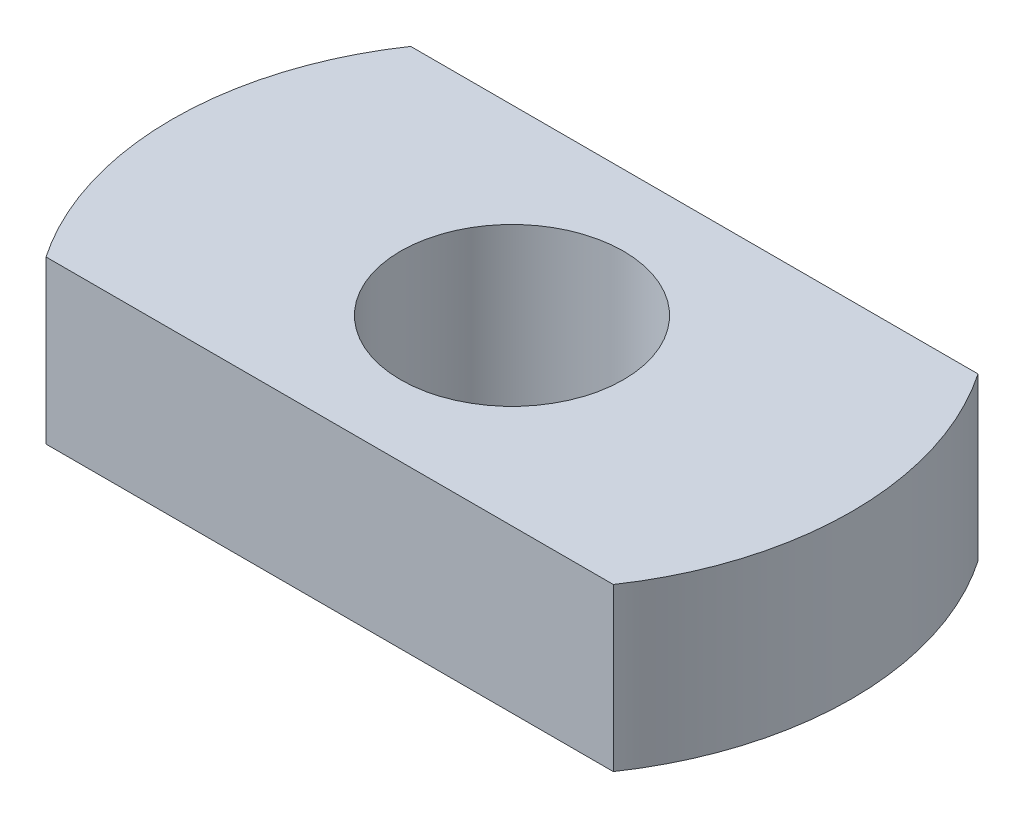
ISO-10303-21;
HEADER;
FILE_DESCRIPTION(('STEP AP214'),'2;1');
FILE_NAME('part.step','',(''),(''),'','','');
FILE_SCHEMA(('AUTOMOTIVE_DESIGN { 1 0 10303 214 1 1 1 1 }'));
ENDSEC;
DATA;
#1=APPLICATION_CONTEXT('core data for automotive mechanical design processes');
#2=APPLICATION_PROTOCOL_DEFINITION('international standard','automotive_design',2000,#1);
#3=PRODUCT_CONTEXT('',#1,'mechanical');
#4=PRODUCT('Part','Part','',(#3));
#5=PRODUCT_RELATED_PRODUCT_CATEGORY('part','',(#4));
#6=PRODUCT_DEFINITION_FORMATION('','',#4);
#7=PRODUCT_DEFINITION_CONTEXT('part definition',#1,'design');
#8=PRODUCT_DEFINITION('design','',#6,#7);
#9=PRODUCT_DEFINITION_SHAPE('','',#8);
#10=(LENGTH_UNIT() NAMED_UNIT(*) SI_UNIT(.MILLI.,.METRE.));
#11=(NAMED_UNIT(*) PLANE_ANGLE_UNIT() SI_UNIT($,.RADIAN.));
#12=(NAMED_UNIT(*) SI_UNIT($,.STERADIAN.) SOLID_ANGLE_UNIT());
#13=UNCERTAINTY_MEASURE_WITH_UNIT(LENGTH_MEASURE(1.E-05),#10,'distance_accuracy_value','');
#14=(GEOMETRIC_REPRESENTATION_CONTEXT(3) GLOBAL_UNCERTAINTY_ASSIGNED_CONTEXT((#13)) GLOBAL_UNIT_ASSIGNED_CONTEXT((#10,
#11,#12)) REPRESENTATION_CONTEXT('',''));
#15=CARTESIAN_POINT('',(0.,0.,0.));
#16=DIRECTION('',(0.,0.,1.));
#17=DIRECTION('',(1.,0.,0.));
#18=AXIS2_PLACEMENT_3D('',#15,#16,#17);
#19=CARTESIAN_POINT('',(-3.85621722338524,40.,0.));
#20=DIRECTION('',(0.,1.,0.));
#21=DIRECTION('',(0.,0.,1.));
#22=AXIS2_PLACEMENT_3D('',#19,#20,#21);
#23=PLANE('',#22);
#24=CARTESIAN_POINT('',(-3.85621722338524,40.,0.));
#25=DIRECTION('',(0.,1.,0.));
#26=DIRECTION('',(0.,0.,1.));
#27=AXIS2_PLACEMENT_3D('',#24,#25,#26);
#28=CIRCLE('',#27,80.);
#29=CARTESIAN_POINT('',(-70.,40.,-45.));
#30=VERTEX_POINT('',#29);
#31=CARTESIAN_POINT('',(-70.,40.,45.));
#32=VERTEX_POINT('',#31);
#33=EDGE_CURVE('E95',#30,#32,#28,.T.);
#34=ORIENTED_EDGE('',*,*,#33,.T.);
#35=DIRECTION('',(1.,0.,0.));
#36=VECTOR('',#35,1.);
#37=CARTESIAN_POINT('',(-70.,40.,45.));
#38=LINE('',#37,#36);
#39=CARTESIAN_POINT('',(70.,40.,45.));
#40=VERTEX_POINT('',#39);
#41=EDGE_CURVE('E90',#32,#40,#38,.T.);
#42=ORIENTED_EDGE('',*,*,#41,.T.);
#43=CARTESIAN_POINT('',(3.85621722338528,40.,0.));
#44=DIRECTION('',(0.,1.,0.));
#45=DIRECTION('',(0.,0.,-1.));
#46=AXIS2_PLACEMENT_3D('',#43,#44,#45);
#47=CIRCLE('',#46,80.);
#48=CARTESIAN_POINT('',(70.,40.,-45.));
#49=VERTEX_POINT('',#48);
#50=EDGE_CURVE('E93',#40,#49,#47,.T.);
#51=ORIENTED_EDGE('',*,*,#50,.T.);
#52=DIRECTION('',(-1.,0.,0.));
#53=VECTOR('',#52,1.);
#54=CARTESIAN_POINT('',(-70.,40.,-45.));
#55=LINE('',#54,#53);
#56=EDGE_CURVE('E60',#49,#30,#55,.T.);
#57=ORIENTED_EDGE('',*,*,#56,.T.);
#58=EDGE_LOOP('',(#34,#42,#51,#57));
#59=FACE_BOUND('',#58,.T.);
#60=CARTESIAN_POINT('',(0.,40.,0.));
#61=DIRECTION('',(0.,1.,0.));
#62=DIRECTION('',(0.,0.,1.));
#63=AXIS2_PLACEMENT_3D('',#60,#61,#62);
#64=CIRCLE('',#63,27.5);
#65=CARTESIAN_POINT('',(0.,40.,27.5));
#66=VERTEX_POINT('',#65);
#67=EDGE_CURVE('E110',#66,#66,#64,.T.);
#68=ORIENTED_EDGE('',*,*,#67,.F.);
#69=EDGE_LOOP('',(#68));
#70=FACE_BOUND('',#69,.T.);
#71=ADVANCED_FACE('F43',(#59,#70),#23,.T.);
#72=CARTESIAN_POINT('',(-3.85621722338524,0.,0.));
#73=DIRECTION('',(0.,1.,0.));
#74=DIRECTION('',(0.,0.,1.));
#75=AXIS2_PLACEMENT_3D('',#72,#73,#74);
#76=PLANE('',#75);
#77=CARTESIAN_POINT('',(-3.85621722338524,0.,0.));
#78=DIRECTION('',(0.,1.,0.));
#79=DIRECTION('',(0.,0.,1.));
#80=AXIS2_PLACEMENT_3D('',#77,#78,#79);
#81=CIRCLE('',#80,80.);
#82=CARTESIAN_POINT('',(-70.,0.,-45.));
#83=VERTEX_POINT('',#82);
#84=CARTESIAN_POINT('',(-70.,0.,45.));
#85=VERTEX_POINT('',#84);
#86=EDGE_CURVE('E107',#83,#85,#81,.T.);
#87=ORIENTED_EDGE('',*,*,#86,.F.);
#88=DIRECTION('',(-1.,0.,0.));
#89=VECTOR('',#88,1.);
#90=CARTESIAN_POINT('',(-70.,0.,-45.));
#91=LINE('',#90,#89);
#92=CARTESIAN_POINT('',(70.,0.,-45.));
#93=VERTEX_POINT('',#92);
#94=EDGE_CURVE('E83',#93,#83,#91,.T.);
#95=ORIENTED_EDGE('',*,*,#94,.F.);
#96=CARTESIAN_POINT('',(3.85621722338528,0.,0.));
#97=DIRECTION('',(0.,1.,0.));
#98=DIRECTION('',(0.,0.,-1.));
#99=AXIS2_PLACEMENT_3D('',#96,#97,#98);
#100=CIRCLE('',#99,80.);
#101=CARTESIAN_POINT('',(70.,0.,45.));
#102=VERTEX_POINT('',#101);
#103=EDGE_CURVE('E77',#102,#93,#100,.T.);
#104=ORIENTED_EDGE('',*,*,#103,.F.);
#105=DIRECTION('',(1.,0.,0.));
#106=VECTOR('',#105,1.);
#107=CARTESIAN_POINT('',(-70.,0.,45.));
#108=LINE('',#107,#106);
#109=EDGE_CURVE('E99',#85,#102,#108,.T.);
#110=ORIENTED_EDGE('',*,*,#109,.F.);
#111=EDGE_LOOP('',(#87,#95,#104,#110));
#112=FACE_BOUND('',#111,.T.);
#113=CARTESIAN_POINT('',(0.,0.,0.));
#114=DIRECTION('',(0.,1.,0.));
#115=DIRECTION('',(0.,0.,1.));
#116=AXIS2_PLACEMENT_3D('',#113,#114,#115);
#117=CIRCLE('',#116,27.5);
#118=CARTESIAN_POINT('',(0.,0.,27.5));
#119=VERTEX_POINT('',#118);
#120=EDGE_CURVE('E122',#119,#119,#117,.T.);
#121=ORIENTED_EDGE('',*,*,#120,.T.);
#122=EDGE_LOOP('',(#121));
#123=FACE_BOUND('',#122,.T.);
#124=ADVANCED_FACE('F118',(#112,#123),#76,.F.);
#125=CARTESIAN_POINT('',(-3.85621722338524,40.,0.));
#126=DIRECTION('',(0.,-1.,0.));
#127=DIRECTION('',(0.,0.,-1.));
#128=AXIS2_PLACEMENT_3D('',#125,#126,#127);
#129=CYLINDRICAL_SURFACE('',#128,80.);
#130=ORIENTED_EDGE('',*,*,#86,.T.);
#131=DIRECTION('',(0.,-1.,0.));
#132=VECTOR('',#131,1.);
#133=CARTESIAN_POINT('',(-70.,40.,45.));
#134=LINE('',#133,#132);
#135=EDGE_CURVE('E13',#32,#85,#134,.T.);
#136=ORIENTED_EDGE('',*,*,#135,.F.);
#137=ORIENTED_EDGE('',*,*,#33,.F.);
#138=DIRECTION('',(0.,-1.,0.));
#139=VECTOR('',#138,1.);
#140=CARTESIAN_POINT('',(-70.,40.,-45.));
#141=LINE('',#140,#139);
#142=EDGE_CURVE('E103',#30,#83,#141,.T.);
#143=ORIENTED_EDGE('',*,*,#142,.T.);
#144=EDGE_LOOP('',(#130,#136,#137,#143));
#145=FACE_BOUND('',#144,.T.);
#146=ADVANCED_FACE('F45',(#145),#129,.T.);
#147=CARTESIAN_POINT('',(-70.,40.,45.));
#148=DIRECTION('',(0.,0.,-1.));
#149=DIRECTION('',(-1.,0.,0.));
#150=AXIS2_PLACEMENT_3D('',#147,#148,#149);
#151=PLANE('',#150);
#152=ORIENTED_EDGE('',*,*,#109,.T.);
#153=DIRECTION('',(0.,-1.,0.));
#154=VECTOR('',#153,1.);
#155=CARTESIAN_POINT('',(70.,40.,45.));
#156=LINE('',#155,#154);
#157=EDGE_CURVE('E52',#40,#102,#156,.T.);
#158=ORIENTED_EDGE('',*,*,#157,.F.);
#159=ORIENTED_EDGE('',*,*,#41,.F.);
#160=ORIENTED_EDGE('',*,*,#135,.T.);
#161=EDGE_LOOP('',(#152,#158,#159,#160));
#162=FACE_BOUND('',#161,.T.);
#163=ADVANCED_FACE('F98',(#162),#151,.F.);
#164=CARTESIAN_POINT('',(3.85621722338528,40.,0.));
#165=DIRECTION('',(0.,-1.,0.));
#166=DIRECTION('',(0.,0.,-1.));
#167=AXIS2_PLACEMENT_3D('',#164,#165,#166);
#168=CYLINDRICAL_SURFACE('',#167,80.);
#169=ORIENTED_EDGE('',*,*,#103,.T.);
#170=DIRECTION('',(0.,-1.,0.));
#171=VECTOR('',#170,1.);
#172=CARTESIAN_POINT('',(70.,40.,-45.));
#173=LINE('',#172,#171);
#174=EDGE_CURVE('E100',#49,#93,#173,.T.);
#175=ORIENTED_EDGE('',*,*,#174,.F.);
#176=ORIENTED_EDGE('',*,*,#50,.F.);
#177=ORIENTED_EDGE('',*,*,#157,.T.);
#178=EDGE_LOOP('',(#169,#175,#176,#177));
#179=FACE_BOUND('',#178,.T.);
#180=ADVANCED_FACE('F101',(#179),#168,.T.);
#181=CARTESIAN_POINT('',(-70.,40.,-45.));
#182=DIRECTION('',(0.,0.,1.));
#183=DIRECTION('',(1.,0.,0.));
#184=AXIS2_PLACEMENT_3D('',#181,#182,#183);
#185=PLANE('',#184);
#186=ORIENTED_EDGE('',*,*,#94,.T.);
#187=ORIENTED_EDGE('',*,*,#142,.F.);
#188=ORIENTED_EDGE('',*,*,#56,.F.);
#189=ORIENTED_EDGE('',*,*,#174,.T.);
#190=EDGE_LOOP('',(#186,#187,#188,#189));
#191=FACE_BOUND('',#190,.T.);
#192=ADVANCED_FACE('F115',(#191),#185,.F.);
#193=CARTESIAN_POINT('',(0.,40.,0.));
#194=DIRECTION('',(0.,-1.,0.));
#195=DIRECTION('',(0.,0.,-1.));
#196=AXIS2_PLACEMENT_3D('',#193,#194,#195);
#197=CYLINDRICAL_SURFACE('',#196,27.5);
#198=ORIENTED_EDGE('',*,*,#67,.T.);
#199=EDGE_LOOP('',(#198));
#200=FACE_BOUND('',#199,.T.);
#201=ORIENTED_EDGE('',*,*,#120,.F.);
#202=EDGE_LOOP('',(#201));
#203=FACE_BOUND('',#202,.T.);
#204=ADVANCED_FACE('F128',(#200,#203),#197,.F.);
#205=CLOSED_SHELL('',(#71,#124,#146,#163,#180,#192,#204));
#206=MANIFOLD_SOLID_BREP('B2',#205);
#207=ADVANCED_BREP_SHAPE_REPRESENTATION('',(#18,#206),#14);
#208=SHAPE_DEFINITION_REPRESENTATION(#9,#207);
ENDSEC;
END-ISO-10303-21;
